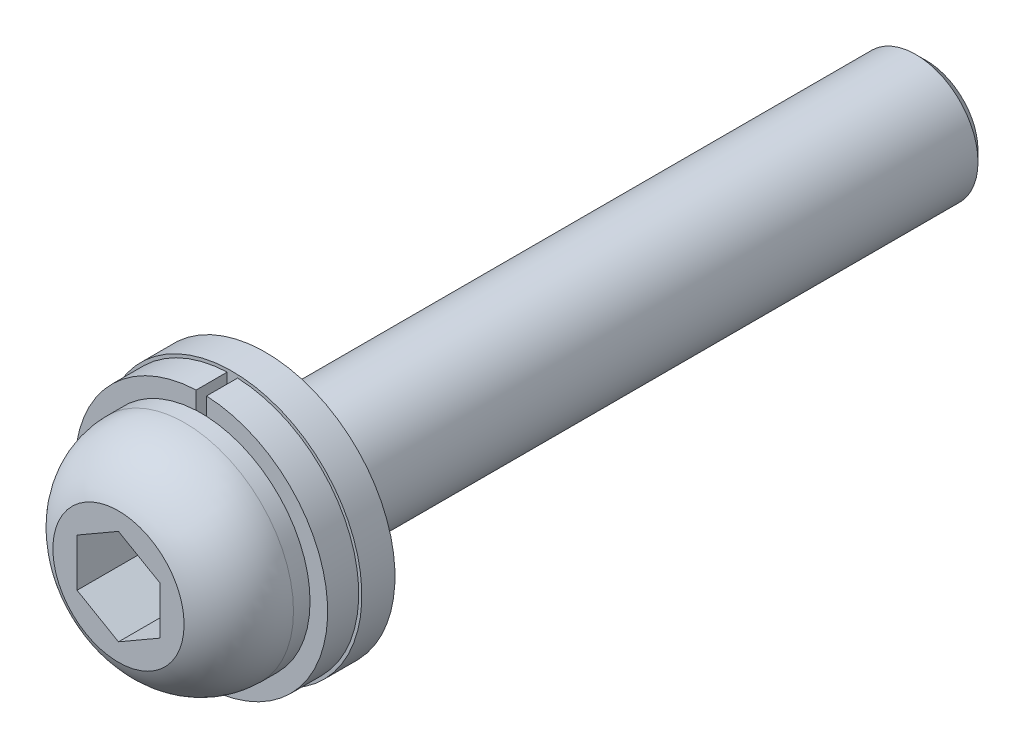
ISO-10303-21;
HEADER;
FILE_DESCRIPTION(('STEP AP214'),'2;1');
FILE_NAME('part.step','',(''),(''),'','','');
FILE_SCHEMA(('AUTOMOTIVE_DESIGN { 1 0 10303 214 1 1 1 1 }'));
ENDSEC;
DATA;
#1=APPLICATION_CONTEXT('core data for automotive mechanical design processes');
#2=APPLICATION_PROTOCOL_DEFINITION('international standard','automotive_design',2000,#1);
#3=PRODUCT_CONTEXT('',#1,'mechanical');
#4=PRODUCT('Part','Part','',(#3));
#5=PRODUCT_RELATED_PRODUCT_CATEGORY('part','',(#4));
#6=PRODUCT_DEFINITION_FORMATION('','',#4);
#7=PRODUCT_DEFINITION_CONTEXT('part definition',#1,'design');
#8=PRODUCT_DEFINITION('design','',#6,#7);
#9=PRODUCT_DEFINITION_SHAPE('','',#8);
#10=(LENGTH_UNIT() NAMED_UNIT(*) SI_UNIT(.MILLI.,.METRE.));
#11=(NAMED_UNIT(*) PLANE_ANGLE_UNIT() SI_UNIT($,.RADIAN.));
#12=(NAMED_UNIT(*) SI_UNIT($,.STERADIAN.) SOLID_ANGLE_UNIT());
#13=UNCERTAINTY_MEASURE_WITH_UNIT(LENGTH_MEASURE(1.E-05),#10,'distance_accuracy_value','');
#14=(GEOMETRIC_REPRESENTATION_CONTEXT(3) GLOBAL_UNCERTAINTY_ASSIGNED_CONTEXT((#13)) GLOBAL_UNIT_ASSIGNED_CONTEXT((#10,
#11,#12)) REPRESENTATION_CONTEXT('',''));
#15=CARTESIAN_POINT('',(0.,0.,0.));
#16=DIRECTION('',(0.,0.,1.));
#17=DIRECTION('',(1.,0.,0.));
#18=AXIS2_PLACEMENT_3D('',#15,#16,#17);
#19=CARTESIAN_POINT('',(0.,0.,1.6));
#20=DIRECTION('',(0.,0.,1.));
#21=DIRECTION('',(-1.,0.,0.));
#22=AXIS2_PLACEMENT_3D('',#19,#20,#21);
#23=PLANE('',#22);
#24=DIRECTION('',(0.,1.,0.));
#25=VECTOR('',#24,1.);
#26=CARTESIAN_POINT('',(-0.25,3.03973683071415,1.6));
#27=LINE('',#26,#25);
#28=CARTESIAN_POINT('',(-0.250000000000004,3.19021942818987,1.6));
#29=VERTEX_POINT('',#28);
#30=CARTESIAN_POINT('',(-0.25,6.09487489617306,1.6));
#31=VERTEX_POINT('',#30);
#32=EDGE_CURVE('E9',#29,#31,#27,.T.);
#33=ORIENTED_EDGE('',*,*,#32,.F.);
#34=CARTESIAN_POINT('',(0.,0.,1.6));
#35=DIRECTION('',(0.,0.,1.));
#36=DIRECTION('',(-1.,0.,0.));
#37=AXIS2_PLACEMENT_3D('',#34,#35,#36);
#38=CIRCLE('',#37,3.2);
#39=CARTESIAN_POINT('',(0.250000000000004,3.19021942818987,1.6));
#40=VERTEX_POINT('',#39);
#41=EDGE_CURVE('E210',#40,#29,#38,.T.);
#42=ORIENTED_EDGE('',*,*,#41,.F.);
#43=DIRECTION('',(0.,-1.,0.));
#44=VECTOR('',#43,1.);
#45=CARTESIAN_POINT('',(0.25,3.03973683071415,1.6));
#46=LINE('',#45,#44);
#47=CARTESIAN_POINT('',(0.25,6.09487489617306,1.6));
#48=VERTEX_POINT('',#47);
#49=EDGE_CURVE('E202',#48,#40,#46,.T.);
#50=ORIENTED_EDGE('',*,*,#49,.F.);
#51=CARTESIAN_POINT('',(0.,0.,1.6));
#52=DIRECTION('',(0.,0.,1.));
#53=DIRECTION('',(1.,0.,0.));
#54=AXIS2_PLACEMENT_3D('',#51,#52,#53);
#55=CIRCLE('',#54,6.1);
#56=EDGE_CURVE('E24',#31,#48,#55,.T.);
#57=ORIENTED_EDGE('',*,*,#56,.F.);
#58=EDGE_LOOP('',(#33,#42,#50,#57));
#59=FACE_BOUND('',#58,.T.);
#60=CARTESIAN_POINT('',(0.,0.,1.6));
#61=DIRECTION('',(0.,0.,1.));
#62=DIRECTION('',(-1.,0.,0.));
#63=AXIS2_PLACEMENT_3D('',#60,#61,#62);
#64=CIRCLE('',#63,6.25);
#65=CARTESIAN_POINT('',(-6.25,0.,1.6));
#66=VERTEX_POINT('',#65);
#67=EDGE_CURVE('E203',#66,#66,#64,.T.);
#68=ORIENTED_EDGE('',*,*,#67,.T.);
#69=EDGE_LOOP('',(#68));
#70=FACE_BOUND('',#69,.T.);
#71=ADVANCED_FACE('F14',(#59,#70),#23,.T.);
#72=CARTESIAN_POINT('',(0.,0.,0.));
#73=DIRECTION('',(0.,0.,1.));
#74=DIRECTION('',(-1.,0.,0.));
#75=AXIS2_PLACEMENT_3D('',#72,#73,#74);
#76=PLANE('',#75);
#77=CARTESIAN_POINT('',(0.,0.,0.));
#78=DIRECTION('',(0.,0.,1.));
#79=DIRECTION('',(-1.,0.,0.));
#80=AXIS2_PLACEMENT_3D('',#77,#78,#79);
#81=CIRCLE('',#80,6.25);
#82=CARTESIAN_POINT('',(-6.25,0.,0.));
#83=VERTEX_POINT('',#82);
#84=EDGE_CURVE('E205',#83,#83,#81,.T.);
#85=ORIENTED_EDGE('',*,*,#84,.F.);
#86=EDGE_LOOP('',(#85));
#87=FACE_BOUND('',#86,.T.);
#88=CARTESIAN_POINT('',(0.,0.,0.));
#89=DIRECTION('',(0.,0.,1.));
#90=DIRECTION('',(-1.,0.,0.));
#91=AXIS2_PLACEMENT_3D('',#88,#89,#90);
#92=CIRCLE('',#91,3.2);
#93=CARTESIAN_POINT('',(-3.2,0.,0.));
#94=VERTEX_POINT('',#93);
#95=EDGE_CURVE('E197',#94,#94,#92,.T.);
#96=ORIENTED_EDGE('',*,*,#95,.T.);
#97=EDGE_LOOP('',(#96));
#98=FACE_BOUND('',#97,.T.);
#99=ADVANCED_FACE('F437',(#87,#98),#76,.F.);
#100=CARTESIAN_POINT('',(0.,0.,1.6));
#101=DIRECTION('',(0.,0.,-1.));
#102=DIRECTION('',(1.,0.,0.));
#103=AXIS2_PLACEMENT_3D('',#100,#101,#102);
#104=CYLINDRICAL_SURFACE('',#103,6.25);
#105=ORIENTED_EDGE('',*,*,#67,.F.);
#106=EDGE_LOOP('',(#105));
#107=FACE_BOUND('',#106,.T.);
#108=ORIENTED_EDGE('',*,*,#84,.T.);
#109=EDGE_LOOP('',(#108));
#110=FACE_BOUND('',#109,.T.);
#111=ADVANCED_FACE('F302',(#107,#110),#104,.T.);
#112=CARTESIAN_POINT('',(0.,0.,1.6));
#113=DIRECTION('',(0.,0.,-1.));
#114=DIRECTION('',(1.,0.,0.));
#115=AXIS2_PLACEMENT_3D('',#112,#113,#114);
#116=CYLINDRICAL_SURFACE('',#115,3.2);
#117=ORIENTED_EDGE('',*,*,#41,.T.);
#118=EDGE_CURVE('E125',#29,#40,#38,.T.);
#119=ORIENTED_EDGE('',*,*,#118,.T.);
#120=EDGE_LOOP('',(#117,#119));
#121=FACE_BOUND('',#120,.T.);
#122=ORIENTED_EDGE('',*,*,#95,.F.);
#123=EDGE_LOOP('',(#122));
#124=FACE_BOUND('',#123,.T.);
#125=ADVANCED_FACE('F294',(#121,#124),#116,.F.);
#126=CARTESIAN_POINT('',(0.,2.30940107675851,4.1));
#127=DIRECTION('',(0.,0.,1.));
#128=DIRECTION('',(1.,0.,0.));
#129=AXIS2_PLACEMENT_3D('',#126,#127,#128);
#130=PLANE('',#129);
#131=DIRECTION('',(-0.866025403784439,0.5,0.));
#132=VECTOR('',#131,1.);
#133=CARTESIAN_POINT('',(2.,1.15470053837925,4.1));
#134=LINE('',#133,#132);
#135=CARTESIAN_POINT('',(2.,1.15470053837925,4.1));
#136=VERTEX_POINT('',#135);
#137=CARTESIAN_POINT('',(0.,2.30940107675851,4.1));
#138=VERTEX_POINT('',#137);
#139=EDGE_CURVE('E160',#136,#138,#134,.T.);
#140=ORIENTED_EDGE('',*,*,#139,.T.);
#141=DIRECTION('',(-0.866025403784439,-0.5,0.));
#142=VECTOR('',#141,1.);
#143=CARTESIAN_POINT('',(0.,2.30940107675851,4.1));
#144=LINE('',#143,#142);
#145=CARTESIAN_POINT('',(-2.,1.15470053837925,4.1));
#146=VERTEX_POINT('',#145);
#147=EDGE_CURVE('E217',#138,#146,#144,.T.);
#148=ORIENTED_EDGE('',*,*,#147,.T.);
#149=DIRECTION('',(0.,-1.,0.));
#150=VECTOR('',#149,1.);
#151=CARTESIAN_POINT('',(-2.,1.15470053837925,4.1));
#152=LINE('',#151,#150);
#153=CARTESIAN_POINT('',(-2.,-1.15470053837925,4.1));
#154=VERTEX_POINT('',#153);
#155=EDGE_CURVE('E220',#146,#154,#152,.T.);
#156=ORIENTED_EDGE('',*,*,#155,.T.);
#157=DIRECTION('',(0.866025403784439,-0.5,0.));
#158=VECTOR('',#157,1.);
#159=CARTESIAN_POINT('',(-2.,-1.15470053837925,4.1));
#160=LINE('',#159,#158);
#161=CARTESIAN_POINT('',(0.,-2.30940107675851,4.1));
#162=VERTEX_POINT('',#161);
#163=EDGE_CURVE('E223',#154,#162,#160,.T.);
#164=ORIENTED_EDGE('',*,*,#163,.T.);
#165=DIRECTION('',(0.866025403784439,0.5,0.));
#166=VECTOR('',#165,1.);
#167=CARTESIAN_POINT('',(0.,-2.30940107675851,4.1));
#168=LINE('',#167,#166);
#169=CARTESIAN_POINT('',(2.,-1.15470053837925,4.1));
#170=VERTEX_POINT('',#169);
#171=EDGE_CURVE('E225',#162,#170,#168,.T.);
#172=ORIENTED_EDGE('',*,*,#171,.T.);
#173=DIRECTION('',(0.,1.,0.));
#174=VECTOR('',#173,1.);
#175=CARTESIAN_POINT('',(2.,-1.15470053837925,4.1));
#176=LINE('',#175,#174);
#177=EDGE_CURVE('E146',#170,#136,#176,.T.);
#178=ORIENTED_EDGE('',*,*,#177,.T.);
#179=EDGE_LOOP('',(#140,#148,#156,#164,#172,#178));
#180=FACE_BOUND('',#179,.T.);
#181=ADVANCED_FACE('F231',(#180),#130,.T.);
#182=CARTESIAN_POINT('',(-2.,1.15470053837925,4.1));
#183=DIRECTION('',(-1.,0.,0.));
#184=DIRECTION('',(0.,-1.,0.));
#185=AXIS2_PLACEMENT_3D('',#182,#183,#184);
#186=PLANE('',#185);
#187=DIRECTION('',(0.,-1.,0.));
#188=VECTOR('',#187,1.);
#189=CARTESIAN_POINT('',(-2.,1.15470053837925,7.1));
#190=LINE('',#189,#188);
#191=CARTESIAN_POINT('',(-2.,1.15470053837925,7.1));
#192=VERTEX_POINT('',#191);
#193=CARTESIAN_POINT('',(-2.,-1.15470053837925,7.1));
#194=VERTEX_POINT('',#193);
#195=EDGE_CURVE('E143',#192,#194,#190,.T.);
#196=ORIENTED_EDGE('',*,*,#195,.T.);
#197=DIRECTION('',(0.,0.,1.));
#198=VECTOR('',#197,1.);
#199=CARTESIAN_POINT('',(-2.,-1.15470053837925,4.1));
#200=LINE('',#199,#198);
#201=EDGE_CURVE('E168',#154,#194,#200,.T.);
#202=ORIENTED_EDGE('',*,*,#201,.F.);
#203=ORIENTED_EDGE('',*,*,#155,.F.);
#204=DIRECTION('',(0.,0.,1.));
#205=VECTOR('',#204,1.);
#206=CARTESIAN_POINT('',(-2.,1.15470053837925,4.1));
#207=LINE('',#206,#205);
#208=EDGE_CURVE('E170',#146,#192,#207,.T.);
#209=ORIENTED_EDGE('',*,*,#208,.T.);
#210=EDGE_LOOP('',(#196,#202,#203,#209));
#211=FACE_BOUND('',#210,.T.);
#212=ADVANCED_FACE('F244',(#211),#186,.F.);
#213=CARTESIAN_POINT('',(-2.,-1.15470053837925,4.1));
#214=DIRECTION('',(-0.5,-0.866025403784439,0.));
#215=DIRECTION('',(0.866025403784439,-0.5,0.));
#216=AXIS2_PLACEMENT_3D('',#213,#214,#215);
#217=PLANE('',#216);
#218=DIRECTION('',(0.866025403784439,-0.5,0.));
#219=VECTOR('',#218,1.);
#220=CARTESIAN_POINT('',(-2.,-1.15470053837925,7.1));
#221=LINE('',#220,#219);
#222=CARTESIAN_POINT('',(0.,-2.30940107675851,7.1));
#223=VERTEX_POINT('',#222);
#224=EDGE_CURVE('E151',#194,#223,#221,.T.);
#225=ORIENTED_EDGE('',*,*,#224,.T.);
#226=DIRECTION('',(0.,0.,1.));
#227=VECTOR('',#226,1.);
#228=CARTESIAN_POINT('',(0.,-2.30940107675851,4.1));
#229=LINE('',#228,#227);
#230=EDGE_CURVE('E166',#162,#223,#229,.T.);
#231=ORIENTED_EDGE('',*,*,#230,.F.);
#232=ORIENTED_EDGE('',*,*,#163,.F.);
#233=ORIENTED_EDGE('',*,*,#201,.T.);
#234=EDGE_LOOP('',(#225,#231,#232,#233));
#235=FACE_BOUND('',#234,.T.);
#236=ADVANCED_FACE('F248',(#235),#217,.F.);
#237=CARTESIAN_POINT('',(0.,-2.30940107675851,4.1));
#238=DIRECTION('',(0.5,-0.866025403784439,0.));
#239=DIRECTION('',(0.866025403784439,0.5,0.));
#240=AXIS2_PLACEMENT_3D('',#237,#238,#239);
#241=PLANE('',#240);
#242=DIRECTION('',(0.866025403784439,0.5,0.));
#243=VECTOR('',#242,1.);
#244=CARTESIAN_POINT('',(0.,-2.30940107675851,7.1));
#245=LINE('',#244,#243);
#246=CARTESIAN_POINT('',(2.,-1.15470053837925,7.1));
#247=VERTEX_POINT('',#246);
#248=EDGE_CURVE('E154',#223,#247,#245,.T.);
#249=ORIENTED_EDGE('',*,*,#248,.T.);
#250=DIRECTION('',(0.,0.,1.));
#251=VECTOR('',#250,1.);
#252=CARTESIAN_POINT('',(2.,-1.15470053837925,4.1));
#253=LINE('',#252,#251);
#254=EDGE_CURVE('E164',#170,#247,#253,.T.);
#255=ORIENTED_EDGE('',*,*,#254,.F.);
#256=ORIENTED_EDGE('',*,*,#171,.F.);
#257=ORIENTED_EDGE('',*,*,#230,.T.);
#258=EDGE_LOOP('',(#249,#255,#256,#257));
#259=FACE_BOUND('',#258,.T.);
#260=ADVANCED_FACE('F251',(#259),#241,.F.);
#261=CARTESIAN_POINT('',(2.,-1.15470053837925,4.1));
#262=DIRECTION('',(1.,0.,0.));
#263=DIRECTION('',(0.,1.,0.));
#264=AXIS2_PLACEMENT_3D('',#261,#262,#263);
#265=PLANE('',#264);
#266=DIRECTION('',(0.,1.,0.));
#267=VECTOR('',#266,1.);
#268=CARTESIAN_POINT('',(2.,-1.15470053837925,7.1));
#269=LINE('',#268,#267);
#270=CARTESIAN_POINT('',(2.,1.15470053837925,7.1));
#271=VERTEX_POINT('',#270);
#272=EDGE_CURVE('E157',#247,#271,#269,.T.);
#273=ORIENTED_EDGE('',*,*,#272,.T.);
#274=DIRECTION('',(0.,0.,1.));
#275=VECTOR('',#274,1.);
#276=CARTESIAN_POINT('',(2.,1.15470053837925,4.1));
#277=LINE('',#276,#275);
#278=EDGE_CURVE('E161',#136,#271,#277,.T.);
#279=ORIENTED_EDGE('',*,*,#278,.F.);
#280=ORIENTED_EDGE('',*,*,#177,.F.);
#281=ORIENTED_EDGE('',*,*,#254,.T.);
#282=EDGE_LOOP('',(#273,#279,#280,#281));
#283=FACE_BOUND('',#282,.T.);
#284=ADVANCED_FACE('F234',(#283),#265,.F.);
#285=CARTESIAN_POINT('',(2.,1.15470053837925,4.1));
#286=DIRECTION('',(0.5,0.866025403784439,0.));
#287=DIRECTION('',(-0.866025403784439,0.5,0.));
#288=AXIS2_PLACEMENT_3D('',#285,#286,#287);
#289=PLANE('',#288);
#290=DIRECTION('',(-0.866025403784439,0.5,0.));
#291=VECTOR('',#290,1.);
#292=CARTESIAN_POINT('',(2.,1.15470053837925,7.1));
#293=LINE('',#292,#291);
#294=CARTESIAN_POINT('',(0.,2.30940107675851,7.1));
#295=VERTEX_POINT('',#294);
#296=EDGE_CURVE('E135',#271,#295,#293,.T.);
#297=ORIENTED_EDGE('',*,*,#296,.T.);
#298=DIRECTION('',(0.,0.,1.));
#299=VECTOR('',#298,1.);
#300=CARTESIAN_POINT('',(0.,2.30940107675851,4.1));
#301=LINE('',#300,#299);
#302=EDGE_CURVE('E172',#138,#295,#301,.T.);
#303=ORIENTED_EDGE('',*,*,#302,.F.);
#304=ORIENTED_EDGE('',*,*,#139,.F.);
#305=ORIENTED_EDGE('',*,*,#278,.T.);
#306=EDGE_LOOP('',(#297,#303,#304,#305));
#307=FACE_BOUND('',#306,.T.);
#308=ADVANCED_FACE('F236',(#307),#289,.F.);
#309=CARTESIAN_POINT('',(0.,2.30940107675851,4.1));
#310=DIRECTION('',(-0.5,0.866025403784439,0.));
#311=DIRECTION('',(-0.866025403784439,-0.5,0.));
#312=AXIS2_PLACEMENT_3D('',#309,#310,#311);
#313=PLANE('',#312);
#314=DIRECTION('',(-0.866025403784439,-0.5,0.));
#315=VECTOR('',#314,1.);
#316=CARTESIAN_POINT('',(0.,2.30940107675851,7.1));
#317=LINE('',#316,#315);
#318=EDGE_CURVE('E137',#295,#192,#317,.T.);
#319=ORIENTED_EDGE('',*,*,#318,.T.);
#320=ORIENTED_EDGE('',*,*,#208,.F.);
#321=ORIENTED_EDGE('',*,*,#147,.F.);
#322=ORIENTED_EDGE('',*,*,#302,.T.);
#323=EDGE_LOOP('',(#319,#320,#321,#322));
#324=FACE_BOUND('',#323,.T.);
#325=ADVANCED_FACE('F240',(#324),#313,.F.);
#326=CARTESIAN_POINT('',(0.,0.,7.1));
#327=DIRECTION('',(0.,0.,-1.));
#328=DIRECTION('',(-1.,0.,0.));
#329=AXIS2_PLACEMENT_3D('',#326,#327,#328);
#330=PLANE('',#329);
#331=ORIENTED_EDGE('',*,*,#318,.F.);
#332=ORIENTED_EDGE('',*,*,#296,.F.);
#333=ORIENTED_EDGE('',*,*,#272,.F.);
#334=ORIENTED_EDGE('',*,*,#248,.F.);
#335=ORIENTED_EDGE('',*,*,#224,.F.);
#336=ORIENTED_EDGE('',*,*,#195,.F.);
#337=EDGE_LOOP('',(#331,#332,#333,#334,#335,#336));
#338=FACE_BOUND('',#337,.T.);
#339=CARTESIAN_POINT('',(0.,0.,7.1));
#340=DIRECTION('',(0.,0.,1.));
#341=DIRECTION('',(1.,0.,0.));
#342=AXIS2_PLACEMENT_3D('',#339,#340,#341);
#343=CIRCLE('',#342,3.16774468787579);
#344=CARTESIAN_POINT('',(3.16774468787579,0.,7.1));
#345=VERTEX_POINT('',#344);
#346=EDGE_CURVE('E176',#345,#345,#343,.T.);
#347=ORIENTED_EDGE('',*,*,#346,.T.);
#348=EDGE_LOOP('',(#347));
#349=FACE_BOUND('',#348,.T.);
#350=ADVANCED_FACE('F253',(#338,#349),#330,.F.);
#351=CARTESIAN_POINT('',(-3.,0.,-31.9));
#352=DIRECTION('',(0.,0.,1.));
#353=DIRECTION('',(1.,0.,0.));
#354=AXIS2_PLACEMENT_3D('',#351,#352,#353);
#355=PLANE('',#354);
#356=CARTESIAN_POINT('',(0.,0.,-31.9));
#357=DIRECTION('',(0.,0.,1.));
#358=DIRECTION('',(1.,0.,0.));
#359=AXIS2_PLACEMENT_3D('',#356,#357,#358);
#360=CIRCLE('',#359,2.5);
#361=CARTESIAN_POINT('',(2.5,0.,-31.9));
#362=VERTEX_POINT('',#361);
#363=EDGE_CURVE('E189',#362,#362,#360,.F.);
#364=ORIENTED_EDGE('',*,*,#363,.T.);
#365=EDGE_LOOP('',(#364));
#366=FACE_BOUND('',#365,.T.);
#367=ADVANCED_FACE('F256',(#366),#355,.F.);
#368=CARTESIAN_POINT('',(0.,0.,3.9));
#369=DIRECTION('',(0.,0.,1.));
#370=DIRECTION('',(1.,0.,0.));
#371=AXIS2_PLACEMENT_3D('',#368,#369,#370);
#372=DEGENERATE_TOROIDAL_SURFACE('',#371,1.75,3.5,.T.);
#373=ORIENTED_EDGE('',*,*,#346,.F.);
#374=EDGE_LOOP('',(#373));
#375=FACE_BOUND('',#374,.T.);
#376=CARTESIAN_POINT('',(0.,0.,3.9));
#377=DIRECTION('',(0.,0.,1.));
#378=DIRECTION('',(1.,0.,0.));
#379=AXIS2_PLACEMENT_3D('',#376,#377,#378);
#380=CIRCLE('',#379,5.25);
#381=CARTESIAN_POINT('',(5.25,0.,3.9));
#382=VERTEX_POINT('',#381);
#383=EDGE_CURVE('E179',#382,#382,#380,.T.);
#384=ORIENTED_EDGE('',*,*,#383,.T.);
#385=EDGE_LOOP('',(#384));
#386=FACE_BOUND('',#385,.T.);
#387=ADVANCED_FACE('F262',(#375,#386),#372,.T.);
#388=CARTESIAN_POINT('',(0.,0.,-31.4));
#389=DIRECTION('',(0.,0.,1.));
#390=DIRECTION('',(1.,0.,0.));
#391=AXIS2_PLACEMENT_3D('',#388,#389,#390);
#392=CONICAL_SURFACE('',#391,3.,0.785398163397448);
#393=ORIENTED_EDGE('',*,*,#363,.F.);
#394=EDGE_LOOP('',(#393));
#395=FACE_BOUND('',#394,.T.);
#396=CARTESIAN_POINT('',(0.,0.,-31.4));
#397=DIRECTION('',(0.,0.,1.));
#398=DIRECTION('',(1.,0.,0.));
#399=AXIS2_PLACEMENT_3D('',#396,#397,#398);
#400=CIRCLE('',#399,3.);
#401=CARTESIAN_POINT('',(3.,0.,-31.4));
#402=VERTEX_POINT('',#401);
#403=EDGE_CURVE('E186',#402,#402,#400,.T.);
#404=ORIENTED_EDGE('',*,*,#403,.F.);
#405=EDGE_LOOP('',(#404));
#406=FACE_BOUND('',#405,.T.);
#407=ADVANCED_FACE('F259',(#395,#406),#392,.T.);
#408=CARTESIAN_POINT('',(0.,0.,7.1));
#409=DIRECTION('',(0.,0.,1.));
#410=DIRECTION('',(1.,0.,0.));
#411=AXIS2_PLACEMENT_3D('',#408,#409,#410);
#412=CYLINDRICAL_SURFACE('',#411,5.25);
#413=ORIENTED_EDGE('',*,*,#383,.F.);
#414=EDGE_LOOP('',(#413));
#415=FACE_BOUND('',#414,.T.);
#416=CARTESIAN_POINT('',(0.,0.,3.1));
#417=DIRECTION('',(0.,0.,1.));
#418=DIRECTION('',(1.,0.,0.));
#419=AXIS2_PLACEMENT_3D('',#416,#417,#418);
#420=CIRCLE('',#419,5.25);
#421=CARTESIAN_POINT('',(0.25,5.24404424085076,3.1));
#422=VERTEX_POINT('',#421);
#423=CARTESIAN_POINT('',(-0.25,5.24404424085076,3.1));
#424=VERTEX_POINT('',#423);
#425=EDGE_CURVE('E183',#422,#424,#420,.T.);
#426=ORIENTED_EDGE('',*,*,#425,.T.);
#427=EDGE_CURVE('E182',#424,#422,#420,.T.);
#428=ORIENTED_EDGE('',*,*,#427,.T.);
#429=EDGE_LOOP('',(#426,#428));
#430=FACE_BOUND('',#429,.T.);
#431=ADVANCED_FACE('F266',(#415,#430),#412,.T.);
#432=CARTESIAN_POINT('',(0.,0.,7.1));
#433=DIRECTION('',(0.,0.,1.));
#434=DIRECTION('',(1.,0.,0.));
#435=AXIS2_PLACEMENT_3D('',#432,#433,#434);
#436=CYLINDRICAL_SURFACE('',#435,3.);
#437=ORIENTED_EDGE('',*,*,#403,.T.);
#438=EDGE_LOOP('',(#437));
#439=FACE_BOUND('',#438,.T.);
#440=CARTESIAN_POINT('',(0.,0.,3.1));
#441=DIRECTION('',(0.,0.,1.));
#442=DIRECTION('',(1.,0.,0.));
#443=AXIS2_PLACEMENT_3D('',#440,#441,#442);
#444=CIRCLE('',#443,3.);
#445=CARTESIAN_POINT('',(3.,0.,3.1));
#446=VERTEX_POINT('',#445);
#447=EDGE_CURVE('E163',#446,#446,#444,.T.);
#448=ORIENTED_EDGE('',*,*,#447,.F.);
#449=EDGE_LOOP('',(#448));
#450=FACE_BOUND('',#449,.T.);
#451=ADVANCED_FACE('F258',(#439,#450),#436,.T.);
#452=CARTESIAN_POINT('',(0.,0.,3.1));
#453=DIRECTION('',(0.,0.,-1.));
#454=DIRECTION('',(-1.,0.,0.));
#455=AXIS2_PLACEMENT_3D('',#452,#453,#454);
#456=CYLINDRICAL_SURFACE('',#455,6.1);
#457=ORIENTED_EDGE('',*,*,#56,.T.);
#458=DIRECTION('',(0.,0.,-1.));
#459=VECTOR('',#458,1.);
#460=CARTESIAN_POINT('',(0.25,6.09487489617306,3.1));
#461=LINE('',#460,#459);
#462=CARTESIAN_POINT('',(0.25,6.09487489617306,3.1));
#463=VERTEX_POINT('',#462);
#464=EDGE_CURVE('E18',#463,#48,#461,.T.);
#465=ORIENTED_EDGE('',*,*,#464,.F.);
#466=CARTESIAN_POINT('',(0.,0.,3.1));
#467=DIRECTION('',(0.,0.,1.));
#468=DIRECTION('',(1.,0.,0.));
#469=AXIS2_PLACEMENT_3D('',#466,#467,#468);
#470=CIRCLE('',#469,6.1);
#471=CARTESIAN_POINT('',(-0.25,6.09487489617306,3.1));
#472=VERTEX_POINT('',#471);
#473=EDGE_CURVE('E126',#472,#463,#470,.T.);
#474=ORIENTED_EDGE('',*,*,#473,.F.);
#475=DIRECTION('',(0.,0.,-1.));
#476=VECTOR('',#475,1.);
#477=CARTESIAN_POINT('',(-0.25,6.09487489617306,3.1));
#478=LINE('',#477,#476);
#479=EDGE_CURVE('E120',#472,#31,#478,.T.);
#480=ORIENTED_EDGE('',*,*,#479,.T.);
#481=EDGE_LOOP('',(#457,#465,#474,#480));
#482=FACE_BOUND('',#481,.T.);
#483=ADVANCED_FACE('F16',(#482),#456,.T.);
#484=CARTESIAN_POINT('',(0.,0.,3.1));
#485=DIRECTION('',(0.,0.,1.));
#486=DIRECTION('',(1.,0.,0.));
#487=AXIS2_PLACEMENT_3D('',#484,#485,#486);
#488=PLANE('',#487);
#489=ORIENTED_EDGE('',*,*,#427,.F.);
#490=DIRECTION('',(0.,1.,0.));
#491=VECTOR('',#490,1.);
#492=CARTESIAN_POINT('',(-0.25,3.03973683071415,3.1));
#493=LINE('',#492,#491);
#494=EDGE_CURVE('E133',#424,#472,#493,.T.);
#495=ORIENTED_EDGE('',*,*,#494,.T.);
#496=ORIENTED_EDGE('',*,*,#473,.T.);
#497=DIRECTION('',(0.,-1.,0.));
#498=VECTOR('',#497,1.);
#499=CARTESIAN_POINT('',(0.25,3.03973683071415,3.1));
#500=LINE('',#499,#498);
#501=EDGE_CURVE('E128',#463,#422,#500,.T.);
#502=ORIENTED_EDGE('',*,*,#501,.T.);
#503=EDGE_LOOP('',(#489,#495,#496,#502));
#504=FACE_BOUND('',#503,.T.);
#505=ADVANCED_FACE('F273',(#504),#488,.T.);
#506=CARTESIAN_POINT('',(-3.,0.,3.1));
#507=DIRECTION('',(0.,0.,1.));
#508=DIRECTION('',(1.,0.,0.));
#509=AXIS2_PLACEMENT_3D('',#506,#507,#508);
#510=PLANE('',#509);
#511=ORIENTED_EDGE('',*,*,#447,.T.);
#512=EDGE_LOOP('',(#511));
#513=FACE_BOUND('',#512,.T.);
#514=DIRECTION('',(0.,1.,0.));
#515=VECTOR('',#514,1.);
#516=CARTESIAN_POINT('',(0.25,0.,3.1));
#517=LINE('',#516,#515);
#518=CARTESIAN_POINT('',(0.25,3.03973683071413,3.1));
#519=VERTEX_POINT('',#518);
#520=EDGE_CURVE('E195',#519,#422,#517,.T.);
#521=ORIENTED_EDGE('',*,*,#520,.F.);
#522=CARTESIAN_POINT('',(0.,0.,3.1));
#523=DIRECTION('',(0.,0.,1.));
#524=DIRECTION('',(-1.,0.,0.));
#525=AXIS2_PLACEMENT_3D('',#522,#523,#524);
#526=CIRCLE('',#525,3.05);
#527=CARTESIAN_POINT('',(-0.25,3.03973683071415,3.1));
#528=VERTEX_POINT('',#527);
#529=EDGE_CURVE('E193',#528,#519,#526,.T.);
#530=ORIENTED_EDGE('',*,*,#529,.F.);
#531=DIRECTION('',(0.,-1.,0.));
#532=VECTOR('',#531,1.);
#533=CARTESIAN_POINT('',(-0.25,0.,3.1));
#534=LINE('',#533,#532);
#535=EDGE_CURVE('E118',#424,#528,#534,.T.);
#536=ORIENTED_EDGE('',*,*,#535,.F.);
#537=ORIENTED_EDGE('',*,*,#425,.F.);
#538=EDGE_LOOP('',(#521,#530,#536,#537));
#539=FACE_BOUND('',#538,.T.);
#540=ADVANCED_FACE('F267',(#513,#539),#510,.F.);
#541=CARTESIAN_POINT('',(0.,0.,3.1));
#542=DIRECTION('',(0.,0.,-1.));
#543=DIRECTION('',(-1.,0.,0.));
#544=AXIS2_PLACEMENT_3D('',#541,#542,#543);
#545=CYLINDRICAL_SURFACE('',#544,3.05);
#546=CARTESIAN_POINT('',(0.,0.,1.6));
#547=DIRECTION('',(0.,0.,-1.));
#548=DIRECTION('',(1.,0.,0.));
#549=AXIS2_PLACEMENT_3D('',#546,#547,#548);
#550=CIRCLE('',#549,3.05);
#551=CARTESIAN_POINT('',(0.25,3.03973683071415,1.6));
#552=VERTEX_POINT('',#551);
#553=CARTESIAN_POINT('',(-0.25,3.03973683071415,1.6));
#554=VERTEX_POINT('',#553);
#555=EDGE_CURVE('E104',#552,#554,#550,.T.);
#556=ORIENTED_EDGE('',*,*,#555,.T.);
#557=DIRECTION('',(0.,0.,-1.));
#558=VECTOR('',#557,1.);
#559=CARTESIAN_POINT('',(-0.25,3.03973683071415,3.1));
#560=LINE('',#559,#558);
#561=EDGE_CURVE('E108',#528,#554,#560,.T.);
#562=ORIENTED_EDGE('',*,*,#561,.F.);
#563=ORIENTED_EDGE('',*,*,#529,.T.);
#564=DIRECTION('',(0.,0.,-1.));
#565=VECTOR('',#564,1.);
#566=CARTESIAN_POINT('',(0.25,3.03973683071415,3.1));
#567=LINE('',#566,#565);
#568=EDGE_CURVE('E109',#519,#552,#567,.T.);
#569=ORIENTED_EDGE('',*,*,#568,.T.);
#570=EDGE_LOOP('',(#556,#562,#563,#569));
#571=FACE_BOUND('',#570,.T.);
#572=ADVANCED_FACE('F106',(#571),#545,.F.);
#573=CARTESIAN_POINT('',(0.,0.,1.6));
#574=DIRECTION('',(0.,0.,1.));
#575=DIRECTION('',(1.,0.,0.));
#576=AXIS2_PLACEMENT_3D('',#573,#574,#575);
#577=PLANE('',#576);
#578=ORIENTED_EDGE('',*,*,#118,.F.);
#579=EDGE_CURVE('E26',#554,#29,#27,.T.);
#580=ORIENTED_EDGE('',*,*,#579,.F.);
#581=ORIENTED_EDGE('',*,*,#555,.F.);
#582=EDGE_CURVE('E98',#40,#552,#46,.T.);
#583=ORIENTED_EDGE('',*,*,#582,.F.);
#584=EDGE_LOOP('',(#578,#580,#581,#583));
#585=FACE_BOUND('',#584,.T.);
#586=ADVANCED_FACE('F123',(#585),#577,.F.);
#587=CARTESIAN_POINT('',(0.25,3.03973683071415,3.1));
#588=DIRECTION('',(1.,0.,0.));
#589=DIRECTION('',(0.,1.,0.));
#590=AXIS2_PLACEMENT_3D('',#587,#588,#589);
#591=PLANE('',#590);
#592=ORIENTED_EDGE('',*,*,#49,.T.);
#593=ORIENTED_EDGE('',*,*,#582,.T.);
#594=ORIENTED_EDGE('',*,*,#568,.F.);
#595=ORIENTED_EDGE('',*,*,#520,.T.);
#596=ORIENTED_EDGE('',*,*,#501,.F.);
#597=ORIENTED_EDGE('',*,*,#464,.T.);
#598=EDGE_LOOP('',(#592,#593,#594,#595,#596,#597));
#599=FACE_BOUND('',#598,.T.);
#600=ADVANCED_FACE('F282',(#599),#591,.F.);
#601=CARTESIAN_POINT('',(-0.25,3.03973683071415,3.1));
#602=DIRECTION('',(-1.,0.,0.));
#603=DIRECTION('',(0.,-1.,0.));
#604=AXIS2_PLACEMENT_3D('',#601,#602,#603);
#605=PLANE('',#604);
#606=ORIENTED_EDGE('',*,*,#579,.T.);
#607=ORIENTED_EDGE('',*,*,#32,.T.);
#608=ORIENTED_EDGE('',*,*,#479,.F.);
#609=ORIENTED_EDGE('',*,*,#494,.F.);
#610=ORIENTED_EDGE('',*,*,#535,.T.);
#611=ORIENTED_EDGE('',*,*,#561,.T.);
#612=EDGE_LOOP('',(#606,#607,#608,#609,#610,#611));
#613=FACE_BOUND('',#612,.T.);
#614=ADVANCED_FACE('F115',(#613),#605,.F.);
#615=CLOSED_SHELL('',(#71,#99,#111,#125,#181,#212,#236,#260,#284,#308,#325,#350,#367,#387,#407,
#431,#451,#483,#505,#540,#572,#586,#600,#614));
#616=MANIFOLD_SOLID_BREP('B1',#615);
#617=ADVANCED_BREP_SHAPE_REPRESENTATION('',(#18,#616),#14);
#618=SHAPE_DEFINITION_REPRESENTATION(#9,#617);
ENDSEC;
END-ISO-10303-21;
